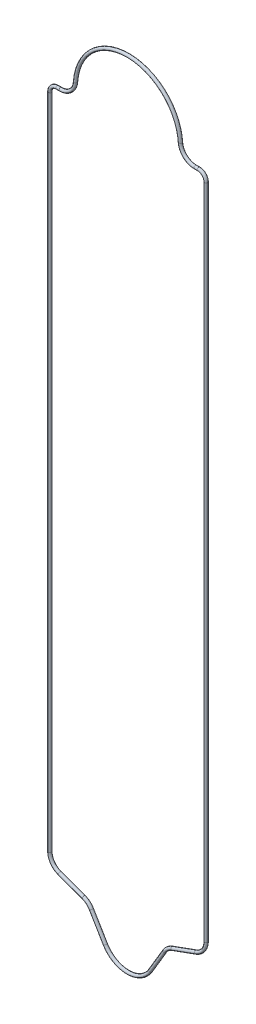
ISO-10303-21;
HEADER;
FILE_DESCRIPTION(('STEP AP214'),'2;1');
FILE_NAME('part.step','',(''),(''),'','','');
FILE_SCHEMA(('AUTOMOTIVE_DESIGN { 1 0 10303 214 1 1 1 1 }'));
ENDSEC;
DATA;
#1=APPLICATION_CONTEXT('core data for automotive mechanical design processes');
#2=APPLICATION_PROTOCOL_DEFINITION('international standard','automotive_design',2000,#1);
#3=PRODUCT_CONTEXT('',#1,'mechanical');
#4=PRODUCT('Part','Part','',(#3));
#5=PRODUCT_RELATED_PRODUCT_CATEGORY('part','',(#4));
#6=PRODUCT_DEFINITION_FORMATION('','',#4);
#7=PRODUCT_DEFINITION_CONTEXT('part definition',#1,'design');
#8=PRODUCT_DEFINITION('design','',#6,#7);
#9=PRODUCT_DEFINITION_SHAPE('','',#8);
#10=(LENGTH_UNIT() NAMED_UNIT(*) SI_UNIT(.MILLI.,.METRE.));
#11=(NAMED_UNIT(*) PLANE_ANGLE_UNIT() SI_UNIT($,.RADIAN.));
#12=(NAMED_UNIT(*) SI_UNIT($,.STERADIAN.) SOLID_ANGLE_UNIT());
#13=UNCERTAINTY_MEASURE_WITH_UNIT(LENGTH_MEASURE(1.E-05),#10,'distance_accuracy_value','');
#14=(GEOMETRIC_REPRESENTATION_CONTEXT(3) GLOBAL_UNCERTAINTY_ASSIGNED_CONTEXT((#13)) GLOBAL_UNIT_ASSIGNED_CONTEXT((#10,
#11,#12)) REPRESENTATION_CONTEXT('',''));
#15=CARTESIAN_POINT('',(0.,0.,0.));
#16=DIRECTION('',(0.,0.,1.));
#17=DIRECTION('',(1.,0.,0.));
#18=AXIS2_PLACEMENT_3D('',#15,#16,#17);
#19=CARTESIAN_POINT('',(8.9792953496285,0.610127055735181,0.));
#20=DIRECTION('',(0.,0.,-1.));
#21=DIRECTION('',(-1.,0.,0.));
#22=AXIS2_PLACEMENT_3D('',#19,#20,#21);
#23=TOROIDAL_SURFACE('',#22,1.99999999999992,0.206304);
#24=CARTESIAN_POINT('',(8.97929534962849,-1.38987294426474,0.));
#25=DIRECTION('',(1.,0.,0.));
#26=DIRECTION('',(0.,0.,-1.));
#27=AXIS2_PLACEMENT_3D('',#24,#25,#26);
#28=CIRCLE('',#27,0.206304);
#29=CARTESIAN_POINT('',(8.97929534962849,-1.59617694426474,0.));
#30=VERTEX_POINT('',#29);
#31=EDGE_CURVE('E30',#30,#30,#28,.T.);
#32=CARTESIAN_POINT('',(6.98389638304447,0.474543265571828,0.));
#33=DIRECTION('',(0.0677918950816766,-0.997699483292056,0.));
#34=DIRECTION('',(0.,0.,-1.));
#35=AXIS2_PLACEMENT_3D('',#32,#33,#34);
#36=CIRCLE('',#35,0.206304);
#37=CARTESIAN_POINT('',(6.77806698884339,0.460557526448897,0.));
#38=VERTEX_POINT('',#37);
#39=EDGE_CURVE('E10',#38,#38,#36,.T.);
#40=CARTESIAN_POINT('',(8.9792953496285,0.610127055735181,0.));
#41=DIRECTION('',(0.,0.,-1.));
#42=DIRECTION('',(-1.,0.,0.));
#43=AXIS2_PLACEMENT_3D('',#40,#41,#42);
#44=CIRCLE('',#43,2.20630399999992);
#45=EDGE_CURVE('',#30,#38,#44,.T.);
#46=ORIENTED_EDGE('',*,*,#31,.F.);
#47=ORIENTED_EDGE('',*,*,#39,.T.);
#48=ORIENTED_EDGE('',*,*,#45,.T.);
#49=ORIENTED_EDGE('',*,*,#45,.F.);
#50=EDGE_LOOP('',(#46,#48,#47,#49));
#51=FACE_BOUND('',#50,.T.);
#52=ADVANCED_FACE('F24',(#51),#23,.T.);
#53=CARTESIAN_POINT('',(9.40647544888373,-1.38987294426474,0.));
#54=DIRECTION('',(-1.,0.,0.));
#55=DIRECTION('',(0.,-1.,0.));
#56=AXIS2_PLACEMENT_3D('',#53,#54,#55);
#57=CYLINDRICAL_SURFACE('',#56,0.206304);
#58=CARTESIAN_POINT('',(9.40647544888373,-1.38987294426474,0.));
#59=DIRECTION('',(1.,0.,0.));
#60=DIRECTION('',(0.,0.,-1.));
#61=AXIS2_PLACEMENT_3D('',#58,#59,#60);
#62=CIRCLE('',#61,0.206304);
#63=CARTESIAN_POINT('',(9.40647544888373,-1.18356894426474,0.));
#64=VERTEX_POINT('',#63);
#65=EDGE_CURVE('E34',#64,#64,#62,.T.);
#66=ORIENTED_EDGE('',*,*,#65,.F.);
#67=EDGE_LOOP('',(#66));
#68=FACE_BOUND('',#67,.T.);
#69=ORIENTED_EDGE('',*,*,#31,.T.);
#70=EDGE_LOOP('',(#69));
#71=FACE_BOUND('',#70,.T.);
#72=ADVANCED_FACE('F176',(#68,#71),#57,.T.);
#73=CARTESIAN_POINT('',(9.40647544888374,-2.38987294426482,0.));
#74=DIRECTION('',(0.,0.,1.));
#75=DIRECTION('',(1.,0.,0.));
#76=AXIS2_PLACEMENT_3D('',#73,#74,#75);
#77=TOROIDAL_SURFACE('',#76,1.00000000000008,0.206304);
#78=CARTESIAN_POINT('',(10.4064754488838,-2.38987294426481,0.));
#79=DIRECTION('',(0.,-1.,0.));
#80=DIRECTION('',(0.,0.,-1.));
#81=AXIS2_PLACEMENT_3D('',#78,#79,#80);
#82=CIRCLE('',#81,0.206304);
#83=CARTESIAN_POINT('',(10.6127794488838,-2.3898729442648,0.));
#84=VERTEX_POINT('',#83);
#85=EDGE_CURVE('E38',#84,#84,#82,.T.);
#86=CARTESIAN_POINT('',(9.40647544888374,-2.38987294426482,0.));
#87=DIRECTION('',(0.,0.,1.));
#88=DIRECTION('',(1.,0.,0.));
#89=AXIS2_PLACEMENT_3D('',#86,#87,#88);
#90=CIRCLE('',#89,1.20630400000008);
#91=EDGE_CURVE('',#84,#64,#90,.T.);
#92=ORIENTED_EDGE('',*,*,#85,.F.);
#93=ORIENTED_EDGE('',*,*,#65,.T.);
#94=ORIENTED_EDGE('',*,*,#91,.T.);
#95=ORIENTED_EDGE('',*,*,#91,.F.);
#96=EDGE_LOOP('',(#92,#94,#93,#95));
#97=FACE_BOUND('',#96,.T.);
#98=ADVANCED_FACE('F170',(#97),#77,.T.);
#99=CARTESIAN_POINT('',(10.4064754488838,-89.9894578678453,0.));
#100=DIRECTION('',(0.,1.,0.));
#101=DIRECTION('',(-1.,0.,0.));
#102=AXIS2_PLACEMENT_3D('',#99,#100,#101);
#103=CYLINDRICAL_SURFACE('',#102,0.206304);
#104=CARTESIAN_POINT('',(10.4064754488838,-89.9894578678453,0.));
#105=DIRECTION('',(0.,-1.,0.));
#106=DIRECTION('',(0.,0.,-1.));
#107=AXIS2_PLACEMENT_3D('',#104,#105,#106);
#108=CIRCLE('',#107,0.206304);
#109=CARTESIAN_POINT('',(10.6127794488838,-89.9894578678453,0.));
#110=VERTEX_POINT('',#109);
#111=EDGE_CURVE('E43',#110,#110,#108,.T.);
#112=ORIENTED_EDGE('',*,*,#111,.F.);
#113=EDGE_LOOP('',(#112));
#114=FACE_BOUND('',#113,.T.);
#115=ORIENTED_EDGE('',*,*,#85,.T.);
#116=EDGE_LOOP('',(#115));
#117=FACE_BOUND('',#116,.T.);
#118=ADVANCED_FACE('F164',(#114,#117),#103,.T.);
#119=CARTESIAN_POINT('',(8.40647544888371,-89.9894578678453,0.));
#120=DIRECTION('',(0.,0.,1.));
#121=DIRECTION('',(1.,0.,0.));
#122=AXIS2_PLACEMENT_3D('',#119,#120,#121);
#123=TOROIDAL_SURFACE('',#122,2.00000000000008,0.206304);
#124=CARTESIAN_POINT('',(9.0905157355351,-91.8688431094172,0.));
#125=DIRECTION('',(-0.939692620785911,-0.342020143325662,0.));
#126=DIRECTION('',(0.,0.,-1.));
#127=AXIS2_PLACEMENT_3D('',#124,#125,#126);
#128=CIRCLE('',#127,0.206304);
#129=CARTESIAN_POINT('',(9.16107585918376,-92.0627054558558,0.));
#130=VERTEX_POINT('',#129);
#131=EDGE_CURVE('E46',#130,#130,#128,.T.);
#132=CARTESIAN_POINT('',(8.40647544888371,-89.9894578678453,0.));
#133=DIRECTION('',(0.,0.,1.));
#134=DIRECTION('',(1.,0.,0.));
#135=AXIS2_PLACEMENT_3D('',#132,#133,#134);
#136=CIRCLE('',#135,2.20630400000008);
#137=EDGE_CURVE('',#130,#110,#136,.T.);
#138=ORIENTED_EDGE('',*,*,#131,.F.);
#139=ORIENTED_EDGE('',*,*,#111,.T.);
#140=ORIENTED_EDGE('',*,*,#137,.T.);
#141=ORIENTED_EDGE('',*,*,#137,.F.);
#142=EDGE_LOOP('',(#138,#140,#139,#141));
#143=FACE_BOUND('',#142,.T.);
#144=ADVANCED_FACE('F158',(#143),#123,.T.);
#145=CARTESIAN_POINT('',(5.9099000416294,-93.0264925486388,0.));
#146=DIRECTION('',(0.939692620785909,0.342020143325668,0.));
#147=DIRECTION('',(-0.342020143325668,0.939692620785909,0.));
#148=AXIS2_PLACEMENT_3D('',#145,#146,#147);
#149=CYLINDRICAL_SURFACE('',#148,0.206304);
#150=CARTESIAN_POINT('',(5.9099000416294,-93.0264925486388,0.));
#151=DIRECTION('',(-0.939692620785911,-0.342020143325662,0.));
#152=DIRECTION('',(0.,0.,-1.));
#153=AXIS2_PLACEMENT_3D('',#150,#151,#152);
#154=CIRCLE('',#153,0.206304);
#155=CARTESIAN_POINT('',(5.83933991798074,-92.8326302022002,0.));
#156=VERTEX_POINT('',#155);
#157=EDGE_CURVE('E49',#156,#156,#154,.T.);
#158=ORIENTED_EDGE('',*,*,#157,.F.);
#159=EDGE_LOOP('',(#158));
#160=FACE_BOUND('',#159,.T.);
#161=ORIENTED_EDGE('',*,*,#131,.T.);
#162=EDGE_LOOP('',(#161));
#163=FACE_BOUND('',#162,.T.);
#164=ADVANCED_FACE('F152',(#160,#163),#149,.T.);
#165=CARTESIAN_POINT('',(6.59394032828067,-94.9058777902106,0.));
#166=DIRECTION('',(0.,0.,-1.));
#167=DIRECTION('',(-1.,0.,0.));
#168=AXIS2_PLACEMENT_3D('',#165,#166,#167);
#169=TOROIDAL_SURFACE('',#168,1.99999999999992,0.206304);
#170=CARTESIAN_POINT('',(4.87359393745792,-93.8858737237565,0.));
#171=DIRECTION('',(-0.510002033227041,-0.860173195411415,0.));
#172=DIRECTION('',(0.,0.,-1.));
#173=AXIS2_PLACEMENT_3D('',#170,#171,#172);
#174=CIRCLE('',#173,0.206304);
#175=CARTESIAN_POINT('',(4.69613676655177,-93.7806582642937,0.));
#176=VERTEX_POINT('',#175);
#177=EDGE_CURVE('E52',#176,#176,#174,.T.);
#178=CARTESIAN_POINT('',(6.59394032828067,-94.9058777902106,0.));
#179=DIRECTION('',(0.,0.,-1.));
#180=DIRECTION('',(-1.,0.,0.));
#181=AXIS2_PLACEMENT_3D('',#178,#179,#180);
#182=CIRCLE('',#181,2.20630399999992);
#183=EDGE_CURVE('',#176,#156,#182,.T.);
#184=ORIENTED_EDGE('',*,*,#177,.F.);
#185=ORIENTED_EDGE('',*,*,#157,.T.);
#186=ORIENTED_EDGE('',*,*,#183,.T.);
#187=ORIENTED_EDGE('',*,*,#183,.F.);
#188=EDGE_LOOP('',(#184,#186,#185,#187));
#189=FACE_BOUND('',#188,.T.);
#190=ADVANCED_FACE('F146',(#189),#169,.T.);
#191=CARTESIAN_POINT('',(3.01060618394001,-97.0280026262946,0.));
#192=DIRECTION('',(0.510002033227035,0.860173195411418,0.));
#193=DIRECTION('',(-0.860173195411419,0.510002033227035,0.));
#194=AXIS2_PLACEMENT_3D('',#191,#192,#193);
#195=CYLINDRICAL_SURFACE('',#194,0.206304);
#196=CARTESIAN_POINT('',(3.01060618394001,-97.0280026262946,0.));
#197=DIRECTION('',(-0.510002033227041,-0.860173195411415,0.));
#198=DIRECTION('',(0.,0.,-1.));
#199=AXIS2_PLACEMENT_3D('',#196,#197,#198);
#200=CIRCLE('',#199,0.206304);
#201=CARTESIAN_POINT('',(3.18806335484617,-97.1332180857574,0.));
#202=VERTEX_POINT('',#201);
#203=EDGE_CURVE('E55',#202,#202,#200,.T.);
#204=ORIENTED_EDGE('',*,*,#203,.F.);
#205=EDGE_LOOP('',(#204));
#206=FACE_BOUND('',#205,.T.);
#207=ORIENTED_EDGE('',*,*,#177,.T.);
#208=EDGE_LOOP('',(#207));
#209=FACE_BOUND('',#208,.T.);
#210=ADVANCED_FACE('F140',(#206,#209),#195,.T.);
#211=CARTESIAN_POINT('',(0.,-95.24299551,0.));
#212=DIRECTION('',(0.,0.,1.));
#213=DIRECTION('',(1.,0.,0.));
#214=AXIS2_PLACEMENT_3D('',#211,#212,#213);
#215=TOROIDAL_SURFACE('',#214,3.50000000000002,0.206304);
#216=CARTESIAN_POINT('',(-3.01060618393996,-97.0280026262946,0.));
#217=DIRECTION('',(-0.510002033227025,0.860173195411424,0.));
#218=DIRECTION('',(0.,0.,-1.));
#219=AXIS2_PLACEMENT_3D('',#216,#217,#218);
#220=CIRCLE('',#219,0.206304);
#221=CARTESIAN_POINT('',(-3.18806335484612,-97.1332180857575,0.));
#222=VERTEX_POINT('',#221);
#223=EDGE_CURVE('E58',#222,#222,#220,.T.);
#224=CARTESIAN_POINT('',(0.,-95.24299551,0.));
#225=DIRECTION('',(0.,0.,1.));
#226=DIRECTION('',(1.,0.,0.));
#227=AXIS2_PLACEMENT_3D('',#224,#225,#226);
#228=CIRCLE('',#227,3.70630400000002);
#229=EDGE_CURVE('',#222,#202,#228,.T.);
#230=ORIENTED_EDGE('',*,*,#223,.F.);
#231=ORIENTED_EDGE('',*,*,#203,.T.);
#232=ORIENTED_EDGE('',*,*,#229,.T.);
#233=ORIENTED_EDGE('',*,*,#229,.F.);
#234=EDGE_LOOP('',(#230,#232,#231,#233));
#235=FACE_BOUND('',#234,.T.);
#236=ADVANCED_FACE('F134',(#235),#215,.T.);
#237=CARTESIAN_POINT('',(-4.87359393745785,-93.8858737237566,0.));
#238=DIRECTION('',(0.510002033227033,-0.860173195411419,0.));
#239=DIRECTION('',(0.860173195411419,0.510002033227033,0.));
#240=AXIS2_PLACEMENT_3D('',#237,#238,#239);
#241=CYLINDRICAL_SURFACE('',#240,0.206304);
#242=CARTESIAN_POINT('',(-4.87359393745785,-93.8858737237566,0.));
#243=DIRECTION('',(-0.510002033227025,0.860173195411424,0.));
#244=DIRECTION('',(0.,0.,-1.));
#245=AXIS2_PLACEMENT_3D('',#242,#243,#244);
#246=CIRCLE('',#245,0.206304);
#247=CARTESIAN_POINT('',(-4.69613676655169,-93.7806582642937,0.));
#248=VERTEX_POINT('',#247);
#249=EDGE_CURVE('E61',#248,#248,#246,.T.);
#250=ORIENTED_EDGE('',*,*,#249,.F.);
#251=EDGE_LOOP('',(#250));
#252=FACE_BOUND('',#251,.T.);
#253=ORIENTED_EDGE('',*,*,#223,.T.);
#254=EDGE_LOOP('',(#253));
#255=FACE_BOUND('',#254,.T.);
#256=ADVANCED_FACE('F128',(#252,#255),#241,.T.);
#257=CARTESIAN_POINT('',(-6.59394032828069,-94.9058777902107,0.));
#258=DIRECTION('',(0.,0.,-1.));
#259=DIRECTION('',(-1.,0.,0.));
#260=AXIS2_PLACEMENT_3D('',#257,#258,#259);
#261=TOROIDAL_SURFACE('',#260,2.,0.206304);
#262=CARTESIAN_POINT('',(-5.90990004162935,-93.0264925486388,0.));
#263=DIRECTION('',(-0.939692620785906,0.342020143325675,0.));
#264=DIRECTION('',(0.,0.,-1.));
#265=AXIS2_PLACEMENT_3D('',#262,#263,#264);
#266=CIRCLE('',#265,0.206304);
#267=CARTESIAN_POINT('',(-5.83933991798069,-92.8326302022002,0.));
#268=VERTEX_POINT('',#267);
#269=EDGE_CURVE('E64',#268,#268,#266,.T.);
#270=CARTESIAN_POINT('',(-6.59394032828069,-94.9058777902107,0.));
#271=DIRECTION('',(0.,0.,-1.));
#272=DIRECTION('',(-1.,0.,0.));
#273=AXIS2_PLACEMENT_3D('',#270,#271,#272);
#274=CIRCLE('',#273,2.206304);
#275=EDGE_CURVE('',#268,#248,#274,.T.);
#276=ORIENTED_EDGE('',*,*,#269,.F.);
#277=ORIENTED_EDGE('',*,*,#249,.T.);
#278=ORIENTED_EDGE('',*,*,#275,.T.);
#279=ORIENTED_EDGE('',*,*,#275,.F.);
#280=EDGE_LOOP('',(#276,#278,#277,#279));
#281=FACE_BOUND('',#280,.T.);
#282=ADVANCED_FACE('F122',(#281),#261,.T.);
#283=CARTESIAN_POINT('',(-9.09051573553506,-91.8688431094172,0.));
#284=DIRECTION('',(0.93969262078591,-0.342020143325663,0.));
#285=DIRECTION('',(0.342020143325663,0.93969262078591,0.));
#286=AXIS2_PLACEMENT_3D('',#283,#284,#285);
#287=CYLINDRICAL_SURFACE('',#286,0.206304);
#288=CARTESIAN_POINT('',(-9.09051573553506,-91.8688431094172,0.));
#289=DIRECTION('',(-0.939692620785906,0.342020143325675,0.));
#290=DIRECTION('',(0.,0.,-1.));
#291=AXIS2_PLACEMENT_3D('',#288,#289,#290);
#292=CIRCLE('',#291,0.206304);
#293=CARTESIAN_POINT('',(-9.16107585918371,-92.0627054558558,0.));
#294=VERTEX_POINT('',#293);
#295=EDGE_CURVE('E67',#294,#294,#292,.T.);
#296=ORIENTED_EDGE('',*,*,#295,.F.);
#297=EDGE_LOOP('',(#296));
#298=FACE_BOUND('',#297,.T.);
#299=ORIENTED_EDGE('',*,*,#269,.T.);
#300=EDGE_LOOP('',(#299));
#301=FACE_BOUND('',#300,.T.);
#302=ADVANCED_FACE('F116',(#298,#301),#287,.T.);
#303=CARTESIAN_POINT('',(-8.40647544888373,-89.9894578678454,0.));
#304=DIRECTION('',(0.,0.,1.));
#305=DIRECTION('',(1.,0.,0.));
#306=AXIS2_PLACEMENT_3D('',#303,#304,#305);
#307=TOROIDAL_SURFACE('',#306,2.00000000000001,0.206304);
#308=CARTESIAN_POINT('',(-10.4064754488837,-89.9894578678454,0.));
#309=DIRECTION('',(0.,1.,0.));
#310=DIRECTION('',(0.,0.,-1.));
#311=AXIS2_PLACEMENT_3D('',#308,#309,#310);
#312=CIRCLE('',#311,0.206304);
#313=CARTESIAN_POINT('',(-10.6127794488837,-89.9894578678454,0.));
#314=VERTEX_POINT('',#313);
#315=EDGE_CURVE('E70',#314,#314,#312,.T.);
#316=CARTESIAN_POINT('',(-8.40647544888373,-89.9894578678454,0.));
#317=DIRECTION('',(0.,0.,1.));
#318=DIRECTION('',(1.,0.,0.));
#319=AXIS2_PLACEMENT_3D('',#316,#317,#318);
#320=CIRCLE('',#319,2.20630400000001);
#321=EDGE_CURVE('',#314,#294,#320,.T.);
#322=ORIENTED_EDGE('',*,*,#315,.F.);
#323=ORIENTED_EDGE('',*,*,#295,.T.);
#324=ORIENTED_EDGE('',*,*,#321,.T.);
#325=ORIENTED_EDGE('',*,*,#321,.F.);
#326=EDGE_LOOP('',(#322,#324,#323,#325));
#327=FACE_BOUND('',#326,.T.);
#328=ADVANCED_FACE('F110',(#327),#307,.T.);
#329=CARTESIAN_POINT('',(-10.4064754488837,-2.38987294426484,0.));
#330=DIRECTION('',(0.,-1.,0.));
#331=DIRECTION('',(1.,0.,0.));
#332=AXIS2_PLACEMENT_3D('',#329,#330,#331);
#333=CYLINDRICAL_SURFACE('',#332,0.206304);
#334=CARTESIAN_POINT('',(-10.4064754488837,-2.38987294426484,0.));
#335=DIRECTION('',(0.,1.,0.));
#336=DIRECTION('',(0.,0.,-1.));
#337=AXIS2_PLACEMENT_3D('',#334,#335,#336);
#338=CIRCLE('',#337,0.206304);
#339=CARTESIAN_POINT('',(-10.6127794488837,-2.38987294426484,0.));
#340=VERTEX_POINT('',#339);
#341=EDGE_CURVE('E73',#340,#340,#338,.T.);
#342=ORIENTED_EDGE('',*,*,#341,.F.);
#343=EDGE_LOOP('',(#342));
#344=FACE_BOUND('',#343,.T.);
#345=ORIENTED_EDGE('',*,*,#315,.T.);
#346=EDGE_LOOP('',(#345));
#347=FACE_BOUND('',#346,.T.);
#348=ADVANCED_FACE('F104',(#344,#347),#333,.T.);
#349=CARTESIAN_POINT('',(-9.40647544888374,-2.38987294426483,0.));
#350=DIRECTION('',(0.,0.,1.));
#351=DIRECTION('',(1.,0.,0.));
#352=AXIS2_PLACEMENT_3D('',#349,#350,#351);
#353=TOROIDAL_SURFACE('',#352,1.,0.206304);
#354=CARTESIAN_POINT('',(-9.40647544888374,-1.38987294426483,0.));
#355=DIRECTION('',(1.,0.,0.));
#356=DIRECTION('',(0.,0.,-1.));
#357=AXIS2_PLACEMENT_3D('',#354,#355,#356);
#358=CIRCLE('',#357,0.206304);
#359=CARTESIAN_POINT('',(-9.40647544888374,-1.18356894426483,0.));
#360=VERTEX_POINT('',#359);
#361=EDGE_CURVE('E76',#360,#360,#358,.T.);
#362=CARTESIAN_POINT('',(-9.40647544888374,-2.38987294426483,0.));
#363=DIRECTION('',(0.,0.,1.));
#364=DIRECTION('',(1.,0.,0.));
#365=AXIS2_PLACEMENT_3D('',#362,#363,#364);
#366=CIRCLE('',#365,1.206304);
#367=EDGE_CURVE('',#360,#340,#366,.T.);
#368=ORIENTED_EDGE('',*,*,#361,.F.);
#369=ORIENTED_EDGE('',*,*,#341,.T.);
#370=ORIENTED_EDGE('',*,*,#367,.T.);
#371=ORIENTED_EDGE('',*,*,#367,.F.);
#372=EDGE_LOOP('',(#368,#370,#369,#371));
#373=FACE_BOUND('',#372,.T.);
#374=ADVANCED_FACE('F98',(#373),#353,.T.);
#375=CARTESIAN_POINT('',(-8.9792953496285,-1.38987294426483,0.));
#376=DIRECTION('',(-1.,0.,0.));
#377=DIRECTION('',(0.,-1.,0.));
#378=AXIS2_PLACEMENT_3D('',#375,#376,#377);
#379=CYLINDRICAL_SURFACE('',#378,0.206304);
#380=CARTESIAN_POINT('',(-8.9792953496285,-1.38987294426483,0.));
#381=DIRECTION('',(1.,0.,0.));
#382=DIRECTION('',(0.,0.,-1.));
#383=AXIS2_PLACEMENT_3D('',#380,#381,#382);
#384=CIRCLE('',#383,0.206304);
#385=CARTESIAN_POINT('',(-8.9792953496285,-1.59617694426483,0.));
#386=VERTEX_POINT('',#385);
#387=EDGE_CURVE('E79',#386,#386,#384,.T.);
#388=ORIENTED_EDGE('',*,*,#387,.F.);
#389=EDGE_LOOP('',(#388));
#390=FACE_BOUND('',#389,.T.);
#391=ORIENTED_EDGE('',*,*,#361,.T.);
#392=EDGE_LOOP('',(#391));
#393=FACE_BOUND('',#392,.T.);
#394=ADVANCED_FACE('F92',(#390,#393),#379,.T.);
#395=CARTESIAN_POINT('',(-8.9792953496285,0.610127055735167,0.));
#396=DIRECTION('',(0.,0.,-1.));
#397=DIRECTION('',(-1.,0.,0.));
#398=AXIS2_PLACEMENT_3D('',#395,#396,#397);
#399=TOROIDAL_SURFACE('',#398,2.,0.206304);
#400=CARTESIAN_POINT('',(-6.98389638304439,0.474543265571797,0.));
#401=DIRECTION('',(0.0677918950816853,0.997699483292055,0.));
#402=DIRECTION('',(0.,0.,-1.));
#403=AXIS2_PLACEMENT_3D('',#400,#401,#402);
#404=CIRCLE('',#403,0.206304);
#405=CARTESIAN_POINT('',(-6.77806698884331,0.460557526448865,0.));
#406=VERTEX_POINT('',#405);
#407=EDGE_CURVE('E82',#406,#406,#404,.T.);
#408=CARTESIAN_POINT('',(-8.9792953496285,0.610127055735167,0.));
#409=DIRECTION('',(0.,0.,-1.));
#410=DIRECTION('',(-1.,0.,0.));
#411=AXIS2_PLACEMENT_3D('',#408,#409,#410);
#412=CIRCLE('',#411,2.206304);
#413=EDGE_CURVE('',#406,#386,#412,.T.);
#414=ORIENTED_EDGE('',*,*,#407,.F.);
#415=ORIENTED_EDGE('',*,*,#387,.T.);
#416=ORIENTED_EDGE('',*,*,#413,.T.);
#417=ORIENTED_EDGE('',*,*,#413,.F.);
#418=EDGE_LOOP('',(#414,#416,#415,#417));
#419=FACE_BOUND('',#418,.T.);
#420=ADVANCED_FACE('F89',(#419),#399,.T.);
#421=CARTESIAN_POINT('',(0.,0.,0.));
#422=DIRECTION('',(0.,0.,-1.));
#423=DIRECTION('',(-1.,0.,0.));
#424=AXIS2_PLACEMENT_3D('',#421,#422,#423);
#425=TOROIDAL_SURFACE('',#424,7.,0.206304);
#426=ORIENTED_EDGE('',*,*,#407,.T.);
#427=EDGE_LOOP('',(#426));
#428=FACE_BOUND('',#427,.T.);
#429=ORIENTED_EDGE('',*,*,#39,.F.);
#430=EDGE_LOOP('',(#429));
#431=FACE_BOUND('',#430,.T.);
#432=ADVANCED_FACE('F86',(#428,#431),#425,.T.);
#433=CLOSED_SHELL('',(#52,#72,#98,#118,#144,#164,#190,#210,#236,#256,#282,#302,#328,#348,#374,
#394,#420,#432));
#434=MANIFOLD_SOLID_BREP('B2',#433);
#435=ADVANCED_BREP_SHAPE_REPRESENTATION('',(#18,#434),#14);
#436=SHAPE_DEFINITION_REPRESENTATION(#9,#435);
ENDSEC;
END-ISO-10303-21;
